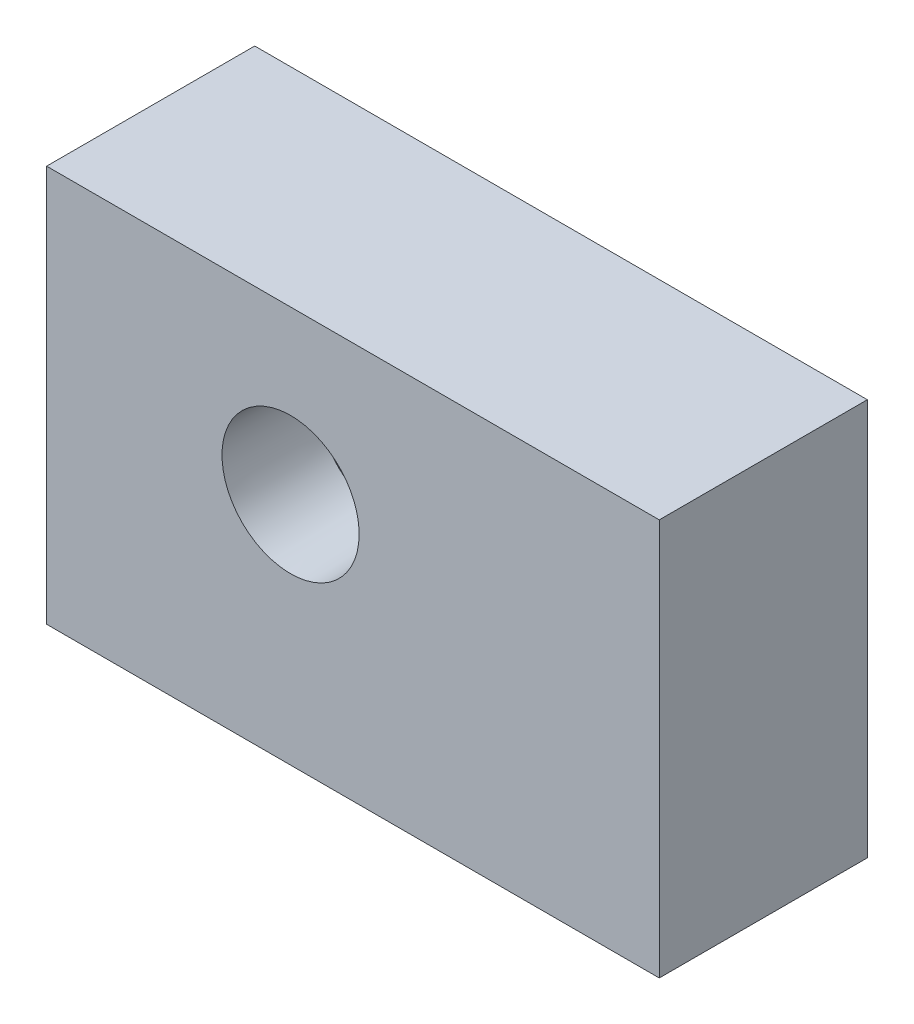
ISO-10303-21;
HEADER;
FILE_DESCRIPTION(('STEP AP214'),'2;1');
FILE_NAME('part.step','',(''),(''),'','','');
FILE_SCHEMA(('AUTOMOTIVE_DESIGN { 1 0 10303 214 1 1 1 1 }'));
ENDSEC;
DATA;
#1=APPLICATION_CONTEXT('core data for automotive mechanical design processes');
#2=APPLICATION_PROTOCOL_DEFINITION('international standard','automotive_design',2000,#1);
#3=PRODUCT_CONTEXT('',#1,'mechanical');
#4=PRODUCT('Part','Part','',(#3));
#5=PRODUCT_RELATED_PRODUCT_CATEGORY('part','',(#4));
#6=PRODUCT_DEFINITION_FORMATION('','',#4);
#7=PRODUCT_DEFINITION_CONTEXT('part definition',#1,'design');
#8=PRODUCT_DEFINITION('design','',#6,#7);
#9=PRODUCT_DEFINITION_SHAPE('','',#8);
#10=(LENGTH_UNIT() NAMED_UNIT(*) SI_UNIT(.MILLI.,.METRE.));
#11=(NAMED_UNIT(*) PLANE_ANGLE_UNIT() SI_UNIT($,.RADIAN.));
#12=(NAMED_UNIT(*) SI_UNIT($,.STERADIAN.) SOLID_ANGLE_UNIT());
#13=UNCERTAINTY_MEASURE_WITH_UNIT(LENGTH_MEASURE(1.E-05),#10,'distance_accuracy_value','');
#14=(GEOMETRIC_REPRESENTATION_CONTEXT(3) GLOBAL_UNCERTAINTY_ASSIGNED_CONTEXT((#13)) GLOBAL_UNIT_ASSIGNED_CONTEXT((#10,
#11,#12)) REPRESENTATION_CONTEXT('',''));
#15=CARTESIAN_POINT('',(0.,0.,0.));
#16=DIRECTION('',(0.,0.,1.));
#17=DIRECTION('',(1.,0.,0.));
#18=AXIS2_PLACEMENT_3D('',#15,#16,#17);
#19=CARTESIAN_POINT('',(0.,0.,30.));
#20=DIRECTION('',(1.,0.,0.));
#21=DIRECTION('',(0.,0.,-1.));
#22=AXIS2_PLACEMENT_3D('',#19,#20,#21);
#23=PLANE('',#22);
#24=DIRECTION('',(0.,-1.,0.));
#25=VECTOR('',#24,1.);
#26=CARTESIAN_POINT('',(0.,0.,0.));
#27=LINE('',#26,#25);
#28=CARTESIAN_POINT('',(0.,57.1994156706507,0.));
#29=VERTEX_POINT('',#28);
#30=CARTESIAN_POINT('',(0.,0.,0.));
#31=VERTEX_POINT('',#30);
#32=EDGE_CURVE('E78',#29,#31,#27,.T.);
#33=ORIENTED_EDGE('',*,*,#32,.T.);
#34=DIRECTION('',(0.,0.,-1.));
#35=VECTOR('',#34,1.);
#36=CARTESIAN_POINT('',(0.,0.,30.));
#37=LINE('',#36,#35);
#38=CARTESIAN_POINT('',(0.,0.,30.));
#39=VERTEX_POINT('',#38);
#40=EDGE_CURVE('E11',#39,#31,#37,.T.);
#41=ORIENTED_EDGE('',*,*,#40,.F.);
#42=DIRECTION('',(0.,-1.,0.));
#43=VECTOR('',#42,1.);
#44=CARTESIAN_POINT('',(0.,0.,30.));
#45=LINE('',#44,#43);
#46=CARTESIAN_POINT('',(0.,57.1994156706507,30.));
#47=VERTEX_POINT('',#46);
#48=EDGE_CURVE('E94',#47,#39,#45,.T.);
#49=ORIENTED_EDGE('',*,*,#48,.F.);
#50=DIRECTION('',(0.,0.,-1.));
#51=VECTOR('',#50,1.);
#52=CARTESIAN_POINT('',(0.,57.1994156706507,30.));
#53=LINE('',#52,#51);
#54=EDGE_CURVE('E100',#47,#29,#53,.T.);
#55=ORIENTED_EDGE('',*,*,#54,.T.);
#56=EDGE_LOOP('',(#33,#41,#49,#55));
#57=FACE_BOUND('',#56,.T.);
#58=ADVANCED_FACE('F27',(#57),#23,.F.);
#59=CARTESIAN_POINT('',(0.,0.,30.));
#60=DIRECTION('',(0.,1.,0.));
#61=DIRECTION('',(0.,0.,1.));
#62=AXIS2_PLACEMENT_3D('',#59,#60,#61);
#63=PLANE('',#62);
#64=DIRECTION('',(1.,0.,0.));
#65=VECTOR('',#64,1.);
#66=CARTESIAN_POINT('',(0.,0.,0.));
#67=LINE('',#66,#65);
#68=CARTESIAN_POINT('',(88.3203098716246,0.,0.));
#69=VERTEX_POINT('',#68);
#70=EDGE_CURVE('E82',#31,#69,#67,.T.);
#71=ORIENTED_EDGE('',*,*,#70,.T.);
#72=DIRECTION('',(0.,0.,-1.));
#73=VECTOR('',#72,1.);
#74=CARTESIAN_POINT('',(88.3203098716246,0.,30.));
#75=LINE('',#74,#73);
#76=CARTESIAN_POINT('',(88.3203098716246,0.,30.));
#77=VERTEX_POINT('',#76);
#78=EDGE_CURVE('E34',#77,#69,#75,.T.);
#79=ORIENTED_EDGE('',*,*,#78,.F.);
#80=DIRECTION('',(1.,0.,0.));
#81=VECTOR('',#80,1.);
#82=CARTESIAN_POINT('',(0.,0.,30.));
#83=LINE('',#82,#81);
#84=EDGE_CURVE('E96',#39,#77,#83,.T.);
#85=ORIENTED_EDGE('',*,*,#84,.F.);
#86=ORIENTED_EDGE('',*,*,#40,.T.);
#87=EDGE_LOOP('',(#71,#79,#85,#86));
#88=FACE_BOUND('',#87,.T.);
#89=ADVANCED_FACE('F120',(#88),#63,.F.);
#90=CARTESIAN_POINT('',(88.3203098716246,0.,30.));
#91=DIRECTION('',(-1.,0.,0.));
#92=DIRECTION('',(0.,0.,1.));
#93=AXIS2_PLACEMENT_3D('',#90,#91,#92);
#94=PLANE('',#93);
#95=DIRECTION('',(0.,1.,0.));
#96=VECTOR('',#95,1.);
#97=CARTESIAN_POINT('',(88.3203098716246,0.,0.));
#98=LINE('',#97,#96);
#99=CARTESIAN_POINT('',(88.3203098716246,57.1994156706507,0.));
#100=VERTEX_POINT('',#99);
#101=EDGE_CURVE('E90',#69,#100,#98,.T.);
#102=ORIENTED_EDGE('',*,*,#101,.T.);
#103=DIRECTION('',(0.,0.,-1.));
#104=VECTOR('',#103,1.);
#105=CARTESIAN_POINT('',(88.3203098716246,57.1994156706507,30.));
#106=LINE('',#105,#104);
#107=CARTESIAN_POINT('',(88.3203098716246,57.1994156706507,30.));
#108=VERTEX_POINT('',#107);
#109=EDGE_CURVE('E103',#108,#100,#106,.T.);
#110=ORIENTED_EDGE('',*,*,#109,.F.);
#111=DIRECTION('',(0.,1.,0.));
#112=VECTOR('',#111,1.);
#113=CARTESIAN_POINT('',(88.3203098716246,0.,30.));
#114=LINE('',#113,#112);
#115=EDGE_CURVE('E46',#77,#108,#114,.T.);
#116=ORIENTED_EDGE('',*,*,#115,.F.);
#117=ORIENTED_EDGE('',*,*,#78,.T.);
#118=EDGE_LOOP('',(#102,#110,#116,#117));
#119=FACE_BOUND('',#118,.T.);
#120=ADVANCED_FACE('F109',(#119),#94,.F.);
#121=CARTESIAN_POINT('',(0.,57.1994156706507,30.));
#122=DIRECTION('',(0.,-1.,0.));
#123=DIRECTION('',(0.,0.,-1.));
#124=AXIS2_PLACEMENT_3D('',#121,#122,#123);
#125=PLANE('',#124);
#126=DIRECTION('',(-1.,0.,0.));
#127=VECTOR('',#126,1.);
#128=CARTESIAN_POINT('',(0.,57.1994156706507,0.));
#129=LINE('',#128,#127);
#130=EDGE_CURVE('E92',#100,#29,#129,.T.);
#131=ORIENTED_EDGE('',*,*,#130,.T.);
#132=ORIENTED_EDGE('',*,*,#54,.F.);
#133=DIRECTION('',(-1.,0.,0.));
#134=VECTOR('',#133,1.);
#135=CARTESIAN_POINT('',(0.,57.1994156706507,30.));
#136=LINE('',#135,#134);
#137=EDGE_CURVE('E41',#108,#47,#136,.T.);
#138=ORIENTED_EDGE('',*,*,#137,.F.);
#139=ORIENTED_EDGE('',*,*,#109,.T.);
#140=EDGE_LOOP('',(#131,#132,#138,#139));
#141=FACE_BOUND('',#140,.T.);
#142=ADVANCED_FACE('F115',(#141),#125,.F.);
#143=CARTESIAN_POINT('',(0.,57.1994156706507,30.));
#144=DIRECTION('',(0.,0.,-1.));
#145=DIRECTION('',(-1.,0.,0.));
#146=AXIS2_PLACEMENT_3D('',#143,#144,#145);
#147=PLANE('',#146);
#148=CARTESIAN_POINT('',(35.1675125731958,33.7812792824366,30.));
#149=DIRECTION('',(0.,0.,1.));
#150=DIRECTION('',(1.,0.,0.));
#151=AXIS2_PLACEMENT_3D('',#148,#149,#150);
#152=CIRCLE('',#151,9.886061);
#153=CARTESIAN_POINT('',(45.0535735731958,33.7812792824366,30.));
#154=VERTEX_POINT('',#153);
#155=EDGE_CURVE('E151',#154,#154,#152,.T.);
#156=ORIENTED_EDGE('',*,*,#155,.F.);
#157=EDGE_LOOP('',(#156));
#158=FACE_BOUND('',#157,.T.);
#159=ORIENTED_EDGE('',*,*,#48,.T.);
#160=ORIENTED_EDGE('',*,*,#84,.T.);
#161=ORIENTED_EDGE('',*,*,#115,.T.);
#162=ORIENTED_EDGE('',*,*,#137,.T.);
#163=EDGE_LOOP('',(#159,#160,#161,#162));
#164=FACE_BOUND('',#163,.T.);
#165=ADVANCED_FACE('F119',(#158,#164),#147,.F.);
#166=CARTESIAN_POINT('',(0.,57.1994156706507,0.));
#167=DIRECTION('',(0.,0.,-1.));
#168=DIRECTION('',(-1.,0.,0.));
#169=AXIS2_PLACEMENT_3D('',#166,#167,#168);
#170=PLANE('',#169);
#171=ORIENTED_EDGE('',*,*,#32,.F.);
#172=ORIENTED_EDGE('',*,*,#130,.F.);
#173=ORIENTED_EDGE('',*,*,#101,.F.);
#174=ORIENTED_EDGE('',*,*,#70,.F.);
#175=EDGE_LOOP('',(#171,#172,#173,#174));
#176=FACE_BOUND('',#175,.T.);
#177=ADVANCED_FACE('F72',(#176),#170,.T.);
#178=CARTESIAN_POINT('',(35.1675125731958,33.7812792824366,7.36100000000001));
#179=DIRECTION('',(0.,0.,1.));
#180=DIRECTION('',(1.,0.,0.));
#181=AXIS2_PLACEMENT_3D('',#178,#179,#180);
#182=CONICAL_SURFACE('',#181,8.92810000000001,1.02974425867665);
#183=CARTESIAN_POINT('',(35.1675125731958,33.7812792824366,1.99645630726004));
#184=VERTEX_POINT('',#183);
#185=VERTEX_LOOP('',#184);
#186=FACE_BOUND('',#185,.T.);
#187=CARTESIAN_POINT('',(35.1675125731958,33.7812792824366,7.36100000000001));
#188=DIRECTION('',(0.,0.,1.));
#189=DIRECTION('',(1.,0.,0.));
#190=AXIS2_PLACEMENT_3D('',#187,#188,#189);
#191=CIRCLE('',#190,8.92810000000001);
#192=CARTESIAN_POINT('',(44.0956125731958,33.7812792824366,7.36100000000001));
#193=VERTEX_POINT('',#192);
#194=EDGE_CURVE('E76',#193,#193,#191,.T.);
#195=ORIENTED_EDGE('',*,*,#194,.T.);
#196=EDGE_LOOP('',(#195));
#197=FACE_BOUND('',#196,.T.);
#198=ADVANCED_FACE('F68',(#186,#197),#182,.F.);
#199=CARTESIAN_POINT('',(35.1675125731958,33.7812792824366,30.));
#200=DIRECTION('',(0.,0.,1.));
#201=DIRECTION('',(1.,0.,0.));
#202=AXIS2_PLACEMENT_3D('',#199,#200,#201);
#203=CYLINDRICAL_SURFACE('',#202,8.9281);
#204=ORIENTED_EDGE('',*,*,#194,.F.);
#205=EDGE_LOOP('',(#204));
#206=FACE_BOUND('',#205,.T.);
#207=CARTESIAN_POINT('',(35.1675125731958,33.7812792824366,16.4288));
#208=DIRECTION('',(0.,0.,1.));
#209=DIRECTION('',(1.,0.,0.));
#210=AXIS2_PLACEMENT_3D('',#207,#208,#209);
#211=CIRCLE('',#210,8.9281);
#212=CARTESIAN_POINT('',(44.0956125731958,33.7812792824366,16.4288));
#213=VERTEX_POINT('',#212);
#214=EDGE_CURVE('E79',#213,#213,#211,.T.);
#215=ORIENTED_EDGE('',*,*,#214,.T.);
#216=EDGE_LOOP('',(#215));
#217=FACE_BOUND('',#216,.T.);
#218=ADVANCED_FACE('F71',(#206,#217),#203,.F.);
#219=CARTESIAN_POINT('',(44.0956125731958,33.7812792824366,16.4288));
#220=DIRECTION('',(0.,0.,-1.));
#221=DIRECTION('',(-1.,0.,0.));
#222=AXIS2_PLACEMENT_3D('',#219,#220,#221);
#223=PLANE('',#222);
#224=ORIENTED_EDGE('',*,*,#214,.F.);
#225=EDGE_LOOP('',(#224));
#226=FACE_BOUND('',#225,.T.);
#227=CARTESIAN_POINT('',(35.1675125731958,33.7812792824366,16.4288));
#228=DIRECTION('',(0.,0.,1.));
#229=DIRECTION('',(1.,0.,0.));
#230=AXIS2_PLACEMENT_3D('',#227,#228,#229);
#231=CIRCLE('',#230,9.47972109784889);
#232=CARTESIAN_POINT('',(44.6472336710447,33.7812792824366,16.4288));
#233=VERTEX_POINT('',#232);
#234=EDGE_CURVE('E85',#233,#233,#231,.T.);
#235=ORIENTED_EDGE('',*,*,#234,.T.);
#236=EDGE_LOOP('',(#235));
#237=FACE_BOUND('',#236,.T.);
#238=ADVANCED_FACE('F137',(#226,#237),#223,.F.);
#239=CARTESIAN_POINT('',(35.1675125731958,33.7812792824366,30.));
#240=DIRECTION('',(0.,0.,1.));
#241=DIRECTION('',(1.,0.,0.));
#242=AXIS2_PLACEMENT_3D('',#239,#240,#241);
#243=CONICAL_SURFACE('',#242,9.886061,0.0299323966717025);
#244=ORIENTED_EDGE('',*,*,#234,.F.);
#245=EDGE_LOOP('',(#244));
#246=FACE_BOUND('',#245,.T.);
#247=ORIENTED_EDGE('',*,*,#155,.T.);
#248=EDGE_LOOP('',(#247));
#249=FACE_BOUND('',#248,.T.);
#250=ADVANCED_FACE('F140',(#246,#249),#243,.F.);
#251=CLOSED_SHELL('',(#58,#89,#120,#142,#165,#177,#198,#218,#238,#250));
#252=MANIFOLD_SOLID_BREP('B2',#251);
#253=ADVANCED_BREP_SHAPE_REPRESENTATION('',(#18,#252),#14);
#254=SHAPE_DEFINITION_REPRESENTATION(#9,#253);
ENDSEC;
END-ISO-10303-21;
